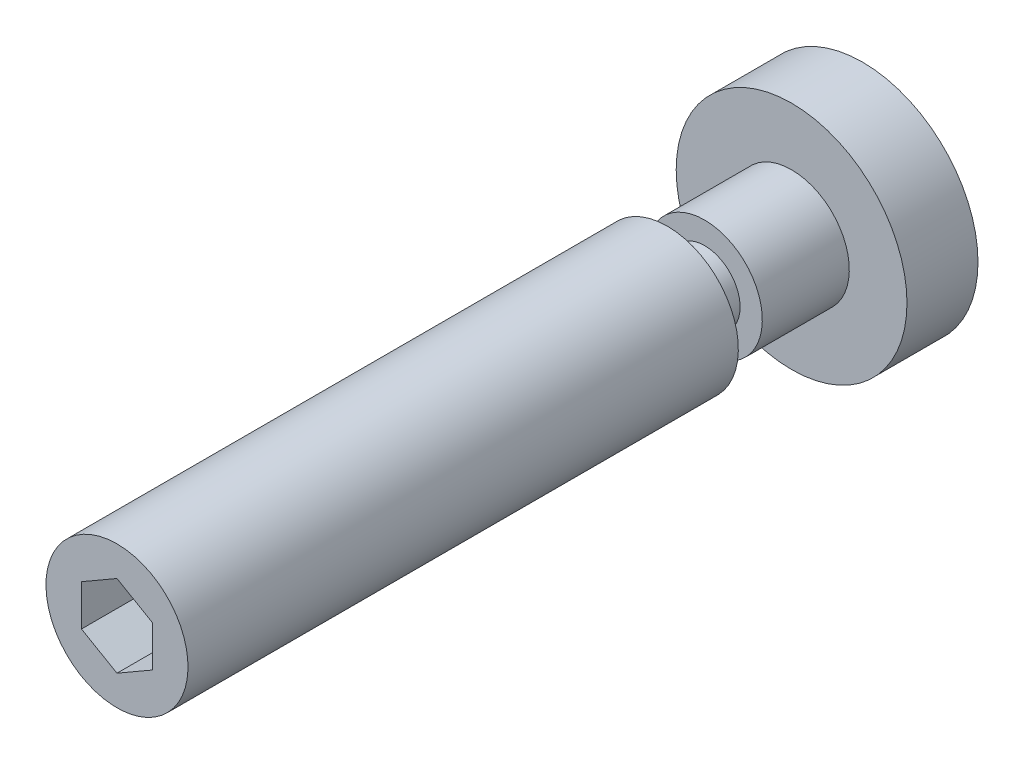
ISO-10303-21;
HEADER;
FILE_DESCRIPTION(('STEP AP214'),'2;1');
FILE_NAME('part.step','',(''),(''),'','','');
FILE_SCHEMA(('AUTOMOTIVE_DESIGN { 1 0 10303 214 1 1 1 1 }'));
ENDSEC;
DATA;
#1=APPLICATION_CONTEXT('core data for automotive mechanical design processes');
#2=APPLICATION_PROTOCOL_DEFINITION('international standard','automotive_design',2000,#1);
#3=PRODUCT_CONTEXT('',#1,'mechanical');
#4=PRODUCT('Part','Part','',(#3));
#5=PRODUCT_RELATED_PRODUCT_CATEGORY('part','',(#4));
#6=PRODUCT_DEFINITION_FORMATION('','',#4);
#7=PRODUCT_DEFINITION_CONTEXT('part definition',#1,'design');
#8=PRODUCT_DEFINITION('design','',#6,#7);
#9=PRODUCT_DEFINITION_SHAPE('','',#8);
#10=(LENGTH_UNIT() NAMED_UNIT(*) SI_UNIT(.MILLI.,.METRE.));
#11=(NAMED_UNIT(*) PLANE_ANGLE_UNIT() SI_UNIT($,.RADIAN.));
#12=(NAMED_UNIT(*) SI_UNIT($,.STERADIAN.) SOLID_ANGLE_UNIT());
#13=UNCERTAINTY_MEASURE_WITH_UNIT(LENGTH_MEASURE(1.E-05),#10,'distance_accuracy_value','');
#14=(GEOMETRIC_REPRESENTATION_CONTEXT(3) GLOBAL_UNCERTAINTY_ASSIGNED_CONTEXT((#13)) GLOBAL_UNIT_ASSIGNED_CONTEXT((#10,
#11,#12)) REPRESENTATION_CONTEXT('',''));
#15=CARTESIAN_POINT('',(0.,0.,0.));
#16=DIRECTION('',(0.,0.,1.));
#17=DIRECTION('',(1.,0.,0.));
#18=AXIS2_PLACEMENT_3D('',#15,#16,#17);
#19=CARTESIAN_POINT('',(0.,0.,0.));
#20=DIRECTION('',(0.,0.,1.));
#21=DIRECTION('',(0.,1.,0.));
#22=AXIS2_PLACEMENT_3D('',#19,#20,#21);
#23=PLANE('',#22);
#24=CARTESIAN_POINT('',(0.,0.,0.));
#25=DIRECTION('',(0.,0.,1.));
#26=DIRECTION('',(0.,1.,0.));
#27=AXIS2_PLACEMENT_3D('',#24,#25,#26);
#28=CIRCLE('',#27,6.5);
#29=CARTESIAN_POINT('',(0.,6.5,0.));
#30=VERTEX_POINT('',#29);
#31=EDGE_CURVE('E9',#30,#30,#28,.T.);
#32=ORIENTED_EDGE('',*,*,#31,.F.);
#33=EDGE_LOOP('',(#32));
#34=FACE_BOUND('',#33,.T.);
#35=ADVANCED_FACE('F14',(#34),#23,.F.);
#36=CARTESIAN_POINT('',(0.,0.,40.));
#37=DIRECTION('',(0.,0.,1.));
#38=DIRECTION('',(0.,1.,0.));
#39=AXIS2_PLACEMENT_3D('',#36,#37,#38);
#40=CYLINDRICAL_SURFACE('',#39,6.5);
#41=CARTESIAN_POINT('',(0.,0.,4.));
#42=DIRECTION('',(0.,0.,1.));
#43=DIRECTION('',(0.,1.,0.));
#44=AXIS2_PLACEMENT_3D('',#41,#42,#43);
#45=CIRCLE('',#44,6.5);
#46=CARTESIAN_POINT('',(0.,6.5,4.));
#47=VERTEX_POINT('',#46);
#48=EDGE_CURVE('E21',#47,#47,#45,.T.);
#49=ORIENTED_EDGE('',*,*,#48,.F.);
#50=EDGE_LOOP('',(#49));
#51=FACE_BOUND('',#50,.T.);
#52=ORIENTED_EDGE('',*,*,#31,.T.);
#53=EDGE_LOOP('',(#52));
#54=FACE_BOUND('',#53,.T.);
#55=ADVANCED_FACE('F142',(#51,#54),#40,.T.);
#56=CARTESIAN_POINT('',(0.,-6.5,4.));
#57=DIRECTION('',(0.,0.,-1.));
#58=DIRECTION('',(0.,-1.,0.));
#59=AXIS2_PLACEMENT_3D('',#56,#57,#58);
#60=PLANE('',#59);
#61=CARTESIAN_POINT('',(0.,0.,4.));
#62=DIRECTION('',(0.,0.,1.));
#63=DIRECTION('',(0.,1.,0.));
#64=AXIS2_PLACEMENT_3D('',#61,#62,#63);
#65=CIRCLE('',#64,3.25);
#66=CARTESIAN_POINT('',(0.,3.25,4.));
#67=VERTEX_POINT('',#66);
#68=EDGE_CURVE('E135',#67,#67,#65,.T.);
#69=ORIENTED_EDGE('',*,*,#68,.F.);
#70=EDGE_LOOP('',(#69));
#71=FACE_BOUND('',#70,.T.);
#72=ORIENTED_EDGE('',*,*,#48,.T.);
#73=EDGE_LOOP('',(#72));
#74=FACE_BOUND('',#73,.T.);
#75=ADVANCED_FACE('F140',(#71,#74),#60,.F.);
#76=CARTESIAN_POINT('',(0.,0.,40.));
#77=DIRECTION('',(0.,0.,1.));
#78=DIRECTION('',(0.,1.,0.));
#79=AXIS2_PLACEMENT_3D('',#76,#77,#78);
#80=CYLINDRICAL_SURFACE('',#79,3.25);
#81=CARTESIAN_POINT('',(0.,0.,8.9));
#82=DIRECTION('',(0.,0.,1.));
#83=DIRECTION('',(0.,1.,0.));
#84=AXIS2_PLACEMENT_3D('',#81,#82,#83);
#85=CIRCLE('',#84,3.25);
#86=CARTESIAN_POINT('',(0.,3.25,8.9));
#87=VERTEX_POINT('',#86);
#88=EDGE_CURVE('E132',#87,#87,#85,.T.);
#89=ORIENTED_EDGE('',*,*,#88,.F.);
#90=EDGE_LOOP('',(#89));
#91=FACE_BOUND('',#90,.T.);
#92=ORIENTED_EDGE('',*,*,#68,.T.);
#93=EDGE_LOOP('',(#92));
#94=FACE_BOUND('',#93,.T.);
#95=ADVANCED_FACE('F165',(#91,#94),#80,.T.);
#96=CARTESIAN_POINT('',(0.,-3.25,8.9));
#97=DIRECTION('',(0.,0.,-1.));
#98=DIRECTION('',(0.,-1.,0.));
#99=AXIS2_PLACEMENT_3D('',#96,#97,#98);
#100=PLANE('',#99);
#101=CARTESIAN_POINT('',(0.,0.,8.9));
#102=DIRECTION('',(0.,0.,1.));
#103=DIRECTION('',(0.,1.,0.));
#104=AXIS2_PLACEMENT_3D('',#101,#102,#103);
#105=CIRCLE('',#104,2.);
#106=CARTESIAN_POINT('',(0.,2.,8.9));
#107=VERTEX_POINT('',#106);
#108=EDGE_CURVE('E129',#107,#107,#105,.T.);
#109=ORIENTED_EDGE('',*,*,#108,.F.);
#110=EDGE_LOOP('',(#109));
#111=FACE_BOUND('',#110,.T.);
#112=ORIENTED_EDGE('',*,*,#88,.T.);
#113=EDGE_LOOP('',(#112));
#114=FACE_BOUND('',#113,.T.);
#115=ADVANCED_FACE('F174',(#111,#114),#100,.F.);
#116=CARTESIAN_POINT('',(0.,0.,40.));
#117=DIRECTION('',(0.,0.,1.));
#118=DIRECTION('',(0.,1.,0.));
#119=AXIS2_PLACEMENT_3D('',#116,#117,#118);
#120=CYLINDRICAL_SURFACE('',#119,2.);
#121=CARTESIAN_POINT('',(0.,0.,11.));
#122=DIRECTION('',(0.,0.,1.));
#123=DIRECTION('',(0.,1.,0.));
#124=AXIS2_PLACEMENT_3D('',#121,#122,#123);
#125=CIRCLE('',#124,2.);
#126=CARTESIAN_POINT('',(0.,2.,11.));
#127=VERTEX_POINT('',#126);
#128=EDGE_CURVE('E126',#127,#127,#125,.T.);
#129=ORIENTED_EDGE('',*,*,#128,.F.);
#130=EDGE_LOOP('',(#129));
#131=FACE_BOUND('',#130,.T.);
#132=ORIENTED_EDGE('',*,*,#108,.T.);
#133=EDGE_LOOP('',(#132));
#134=FACE_BOUND('',#133,.T.);
#135=ADVANCED_FACE('F183',(#131,#134),#120,.T.);
#136=CARTESIAN_POINT('',(0.,-2.,11.));
#137=DIRECTION('',(0.,0.,1.));
#138=DIRECTION('',(0.,1.,0.));
#139=AXIS2_PLACEMENT_3D('',#136,#137,#138);
#140=PLANE('',#139);
#141=CARTESIAN_POINT('',(0.,0.,11.));
#142=DIRECTION('',(0.,0.,1.));
#143=DIRECTION('',(0.,1.,0.));
#144=AXIS2_PLACEMENT_3D('',#141,#142,#143);
#145=CIRCLE('',#144,4.);
#146=CARTESIAN_POINT('',(0.,4.,11.));
#147=VERTEX_POINT('',#146);
#148=EDGE_CURVE('E123',#147,#147,#145,.T.);
#149=ORIENTED_EDGE('',*,*,#148,.F.);
#150=EDGE_LOOP('',(#149));
#151=FACE_BOUND('',#150,.T.);
#152=ORIENTED_EDGE('',*,*,#128,.T.);
#153=EDGE_LOOP('',(#152));
#154=FACE_BOUND('',#153,.T.);
#155=ADVANCED_FACE('F192',(#151,#154),#140,.F.);
#156=CARTESIAN_POINT('',(0.,0.,40.));
#157=DIRECTION('',(0.,0.,1.));
#158=DIRECTION('',(0.,1.,0.));
#159=AXIS2_PLACEMENT_3D('',#156,#157,#158);
#160=CYLINDRICAL_SURFACE('',#159,4.);
#161=CARTESIAN_POINT('',(0.,0.,42.));
#162=DIRECTION('',(0.,0.,1.));
#163=DIRECTION('',(0.,1.,0.));
#164=AXIS2_PLACEMENT_3D('',#161,#162,#163);
#165=CIRCLE('',#164,4.);
#166=CARTESIAN_POINT('',(0.,4.,42.));
#167=VERTEX_POINT('',#166);
#168=EDGE_CURVE('E115',#167,#167,#165,.T.);
#169=ORIENTED_EDGE('',*,*,#168,.F.);
#170=EDGE_LOOP('',(#169));
#171=FACE_BOUND('',#170,.T.);
#172=ORIENTED_EDGE('',*,*,#148,.T.);
#173=EDGE_LOOP('',(#172));
#174=FACE_BOUND('',#173,.T.);
#175=ADVANCED_FACE('F201',(#171,#174),#160,.T.);
#176=CARTESIAN_POINT('',(0.,-4.,42.));
#177=DIRECTION('',(0.,0.,-1.));
#178=DIRECTION('',(0.,-1.,0.));
#179=AXIS2_PLACEMENT_3D('',#176,#177,#178);
#180=PLANE('',#179);
#181=DIRECTION('',(-0.866025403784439,-0.5,0.));
#182=VECTOR('',#181,1.);
#183=CARTESIAN_POINT('',(0.,2.30940107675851,42.));
#184=LINE('',#183,#182);
#185=CARTESIAN_POINT('',(0.,2.30940107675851,42.));
#186=VERTEX_POINT('',#185);
#187=CARTESIAN_POINT('',(-2.,1.15470053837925,42.));
#188=VERTEX_POINT('',#187);
#189=EDGE_CURVE('E102',#186,#188,#184,.T.);
#190=ORIENTED_EDGE('',*,*,#189,.F.);
#191=DIRECTION('',(-0.866025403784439,0.5,0.));
#192=VECTOR('',#191,1.);
#193=CARTESIAN_POINT('',(2.,1.15470053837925,42.));
#194=LINE('',#193,#192);
#195=CARTESIAN_POINT('',(2.,1.15470053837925,42.));
#196=VERTEX_POINT('',#195);
#197=EDGE_CURVE('E28',#196,#186,#194,.T.);
#198=ORIENTED_EDGE('',*,*,#197,.F.);
#199=DIRECTION('',(0.,1.,0.));
#200=VECTOR('',#199,1.);
#201=CARTESIAN_POINT('',(2.,-1.15470053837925,42.));
#202=LINE('',#201,#200);
#203=CARTESIAN_POINT('',(2.,-1.15470053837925,42.));
#204=VERTEX_POINT('',#203);
#205=EDGE_CURVE('E111',#204,#196,#202,.T.);
#206=ORIENTED_EDGE('',*,*,#205,.F.);
#207=DIRECTION('',(0.866025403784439,0.5,0.));
#208=VECTOR('',#207,1.);
#209=CARTESIAN_POINT('',(0.,-2.30940107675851,42.));
#210=LINE('',#209,#208);
#211=CARTESIAN_POINT('',(0.,-2.30940107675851,42.));
#212=VERTEX_POINT('',#211);
#213=EDGE_CURVE('E109',#212,#204,#210,.T.);
#214=ORIENTED_EDGE('',*,*,#213,.F.);
#215=DIRECTION('',(0.866025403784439,-0.5,0.));
#216=VECTOR('',#215,1.);
#217=CARTESIAN_POINT('',(-2.,-1.15470053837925,42.));
#218=LINE('',#217,#216);
#219=CARTESIAN_POINT('',(-2.,-1.15470053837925,42.));
#220=VERTEX_POINT('',#219);
#221=EDGE_CURVE('E76',#220,#212,#218,.T.);
#222=ORIENTED_EDGE('',*,*,#221,.F.);
#223=DIRECTION('',(0.,-1.,0.));
#224=VECTOR('',#223,1.);
#225=CARTESIAN_POINT('',(-2.,1.15470053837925,42.));
#226=LINE('',#225,#224);
#227=EDGE_CURVE('E105',#188,#220,#226,.T.);
#228=ORIENTED_EDGE('',*,*,#227,.F.);
#229=EDGE_LOOP('',(#190,#198,#206,#214,#222,#228));
#230=FACE_BOUND('',#229,.T.);
#231=ORIENTED_EDGE('',*,*,#168,.T.);
#232=EDGE_LOOP('',(#231));
#233=FACE_BOUND('',#232,.T.);
#234=ADVANCED_FACE('F210',(#230,#233),#180,.F.);
#235=CARTESIAN_POINT('',(2.,1.15470053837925,37.));
#236=DIRECTION('',(0.5,0.866025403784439,0.));
#237=DIRECTION('',(-0.866025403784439,0.5,0.));
#238=AXIS2_PLACEMENT_3D('',#235,#236,#237);
#239=PLANE('',#238);
#240=ORIENTED_EDGE('',*,*,#197,.T.);
#241=DIRECTION('',(0.,0.,1.));
#242=VECTOR('',#241,1.);
#243=CARTESIAN_POINT('',(0.,2.30940107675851,37.));
#244=LINE('',#243,#242);
#245=CARTESIAN_POINT('',(0.,2.30940107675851,37.));
#246=VERTEX_POINT('',#245);
#247=EDGE_CURVE('E58',#246,#186,#244,.T.);
#248=ORIENTED_EDGE('',*,*,#247,.F.);
#249=DIRECTION('',(-0.866025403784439,0.5,0.));
#250=VECTOR('',#249,1.);
#251=CARTESIAN_POINT('',(2.,1.15470053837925,37.));
#252=LINE('',#251,#250);
#253=CARTESIAN_POINT('',(2.,1.15470053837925,37.));
#254=VERTEX_POINT('',#253);
#255=EDGE_CURVE('E113',#254,#246,#252,.T.);
#256=ORIENTED_EDGE('',*,*,#255,.F.);
#257=DIRECTION('',(0.,0.,1.));
#258=VECTOR('',#257,1.);
#259=CARTESIAN_POINT('',(2.,1.15470053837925,37.));
#260=LINE('',#259,#258);
#261=EDGE_CURVE('E36',#254,#196,#260,.T.);
#262=ORIENTED_EDGE('',*,*,#261,.T.);
#263=EDGE_LOOP('',(#240,#248,#256,#262));
#264=FACE_BOUND('',#263,.T.);
#265=ADVANCED_FACE('F219',(#264),#239,.F.);
#266=CARTESIAN_POINT('',(2.,-1.15470053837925,37.));
#267=DIRECTION('',(1.,0.,0.));
#268=DIRECTION('',(0.,0.,-1.));
#269=AXIS2_PLACEMENT_3D('',#266,#267,#268);
#270=PLANE('',#269);
#271=ORIENTED_EDGE('',*,*,#205,.T.);
#272=ORIENTED_EDGE('',*,*,#261,.F.);
#273=DIRECTION('',(0.,1.,0.));
#274=VECTOR('',#273,1.);
#275=CARTESIAN_POINT('',(2.,-1.15470053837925,37.));
#276=LINE('',#275,#274);
#277=CARTESIAN_POINT('',(2.,-1.15470053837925,37.));
#278=VERTEX_POINT('',#277);
#279=EDGE_CURVE('E88',#278,#254,#276,.T.);
#280=ORIENTED_EDGE('',*,*,#279,.F.);
#281=DIRECTION('',(0.,0.,1.));
#282=VECTOR('',#281,1.);
#283=CARTESIAN_POINT('',(2.,-1.15470053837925,37.));
#284=LINE('',#283,#282);
#285=EDGE_CURVE('E80',#278,#204,#284,.T.);
#286=ORIENTED_EDGE('',*,*,#285,.T.);
#287=EDGE_LOOP('',(#271,#272,#280,#286));
#288=FACE_BOUND('',#287,.T.);
#289=ADVANCED_FACE('F228',(#288),#270,.F.);
#290=CARTESIAN_POINT('',(0.,-2.30940107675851,37.));
#291=DIRECTION('',(0.5,-0.866025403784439,0.));
#292=DIRECTION('',(0.866025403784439,0.5,0.));
#293=AXIS2_PLACEMENT_3D('',#290,#291,#292);
#294=PLANE('',#293);
#295=ORIENTED_EDGE('',*,*,#213,.T.);
#296=ORIENTED_EDGE('',*,*,#285,.F.);
#297=DIRECTION('',(0.866025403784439,0.5,0.));
#298=VECTOR('',#297,1.);
#299=CARTESIAN_POINT('',(0.,-2.30940107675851,37.));
#300=LINE('',#299,#298);
#301=CARTESIAN_POINT('',(0.,-2.30940107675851,37.));
#302=VERTEX_POINT('',#301);
#303=EDGE_CURVE('E84',#302,#278,#300,.T.);
#304=ORIENTED_EDGE('',*,*,#303,.F.);
#305=DIRECTION('',(0.,0.,1.));
#306=VECTOR('',#305,1.);
#307=CARTESIAN_POINT('',(0.,-2.30940107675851,37.));
#308=LINE('',#307,#306);
#309=EDGE_CURVE('E69',#302,#212,#308,.T.);
#310=ORIENTED_EDGE('',*,*,#309,.T.);
#311=EDGE_LOOP('',(#295,#296,#304,#310));
#312=FACE_BOUND('',#311,.T.);
#313=ADVANCED_FACE('F85',(#312),#294,.F.);
#314=CARTESIAN_POINT('',(-2.,-1.15470053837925,37.));
#315=DIRECTION('',(-0.5,-0.866025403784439,0.));
#316=DIRECTION('',(0.866025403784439,-0.5,0.));
#317=AXIS2_PLACEMENT_3D('',#314,#315,#316);
#318=PLANE('',#317);
#319=ORIENTED_EDGE('',*,*,#221,.T.);
#320=ORIENTED_EDGE('',*,*,#309,.F.);
#321=DIRECTION('',(0.866025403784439,-0.5,0.));
#322=VECTOR('',#321,1.);
#323=CARTESIAN_POINT('',(-2.,-1.15470053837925,37.));
#324=LINE('',#323,#322);
#325=CARTESIAN_POINT('',(-2.,-1.15470053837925,37.));
#326=VERTEX_POINT('',#325);
#327=EDGE_CURVE('E73',#326,#302,#324,.T.);
#328=ORIENTED_EDGE('',*,*,#327,.F.);
#329=DIRECTION('',(0.,0.,1.));
#330=VECTOR('',#329,1.);
#331=CARTESIAN_POINT('',(-2.,-1.15470053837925,37.));
#332=LINE('',#331,#330);
#333=EDGE_CURVE('E81',#326,#220,#332,.T.);
#334=ORIENTED_EDGE('',*,*,#333,.T.);
#335=EDGE_LOOP('',(#319,#320,#328,#334));
#336=FACE_BOUND('',#335,.T.);
#337=ADVANCED_FACE('F71',(#336),#318,.F.);
#338=CARTESIAN_POINT('',(-2.,1.15470053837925,37.));
#339=DIRECTION('',(-1.,0.,0.));
#340=DIRECTION('',(0.,-1.,0.));
#341=AXIS2_PLACEMENT_3D('',#338,#339,#340);
#342=PLANE('',#341);
#343=ORIENTED_EDGE('',*,*,#227,.T.);
#344=ORIENTED_EDGE('',*,*,#333,.F.);
#345=DIRECTION('',(0.,-1.,0.));
#346=VECTOR('',#345,1.);
#347=CARTESIAN_POINT('',(-2.,1.15470053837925,37.));
#348=LINE('',#347,#346);
#349=CARTESIAN_POINT('',(-2.,1.15470053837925,37.));
#350=VERTEX_POINT('',#349);
#351=EDGE_CURVE('E94',#350,#326,#348,.T.);
#352=ORIENTED_EDGE('',*,*,#351,.F.);
#353=DIRECTION('',(0.,0.,1.));
#354=VECTOR('',#353,1.);
#355=CARTESIAN_POINT('',(-2.,1.15470053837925,37.));
#356=LINE('',#355,#354);
#357=EDGE_CURVE('E118',#350,#188,#356,.T.);
#358=ORIENTED_EDGE('',*,*,#357,.T.);
#359=EDGE_LOOP('',(#343,#344,#352,#358));
#360=FACE_BOUND('',#359,.T.);
#361=ADVANCED_FACE('F250',(#360),#342,.F.);
#362=CARTESIAN_POINT('',(0.,2.30940107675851,37.));
#363=DIRECTION('',(-0.5,0.866025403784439,0.));
#364=DIRECTION('',(-0.866025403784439,-0.5,0.));
#365=AXIS2_PLACEMENT_3D('',#362,#363,#364);
#366=PLANE('',#365);
#367=ORIENTED_EDGE('',*,*,#189,.T.);
#368=ORIENTED_EDGE('',*,*,#357,.F.);
#369=DIRECTION('',(-0.866025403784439,-0.5,0.));
#370=VECTOR('',#369,1.);
#371=CARTESIAN_POINT('',(0.,2.30940107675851,37.));
#372=LINE('',#371,#370);
#373=EDGE_CURVE('E96',#246,#350,#372,.T.);
#374=ORIENTED_EDGE('',*,*,#373,.F.);
#375=ORIENTED_EDGE('',*,*,#247,.T.);
#376=EDGE_LOOP('',(#367,#368,#374,#375));
#377=FACE_BOUND('',#376,.T.);
#378=ADVANCED_FACE('F258',(#377),#366,.F.);
#379=CARTESIAN_POINT('',(0.,2.30940107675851,37.));
#380=DIRECTION('',(0.,0.,1.));
#381=DIRECTION('',(1.,0.,0.));
#382=AXIS2_PLACEMENT_3D('',#379,#380,#381);
#383=PLANE('',#382);
#384=ORIENTED_EDGE('',*,*,#255,.T.);
#385=ORIENTED_EDGE('',*,*,#373,.T.);
#386=ORIENTED_EDGE('',*,*,#351,.T.);
#387=ORIENTED_EDGE('',*,*,#327,.T.);
#388=ORIENTED_EDGE('',*,*,#303,.T.);
#389=ORIENTED_EDGE('',*,*,#279,.T.);
#390=EDGE_LOOP('',(#384,#385,#386,#387,#388,#389));
#391=FACE_BOUND('',#390,.T.);
#392=ADVANCED_FACE('F91',(#391),#383,.T.);
#393=CLOSED_SHELL('',(#35,#55,#75,#95,#115,#135,#155,#175,#234,#265,#289,#313,#337,#361,#378,#392));
#394=MANIFOLD_SOLID_BREP('B1',#393);
#395=ADVANCED_BREP_SHAPE_REPRESENTATION('',(#18,#394),#14);
#396=SHAPE_DEFINITION_REPRESENTATION(#9,#395);
ENDSEC;
END-ISO-10303-21;
